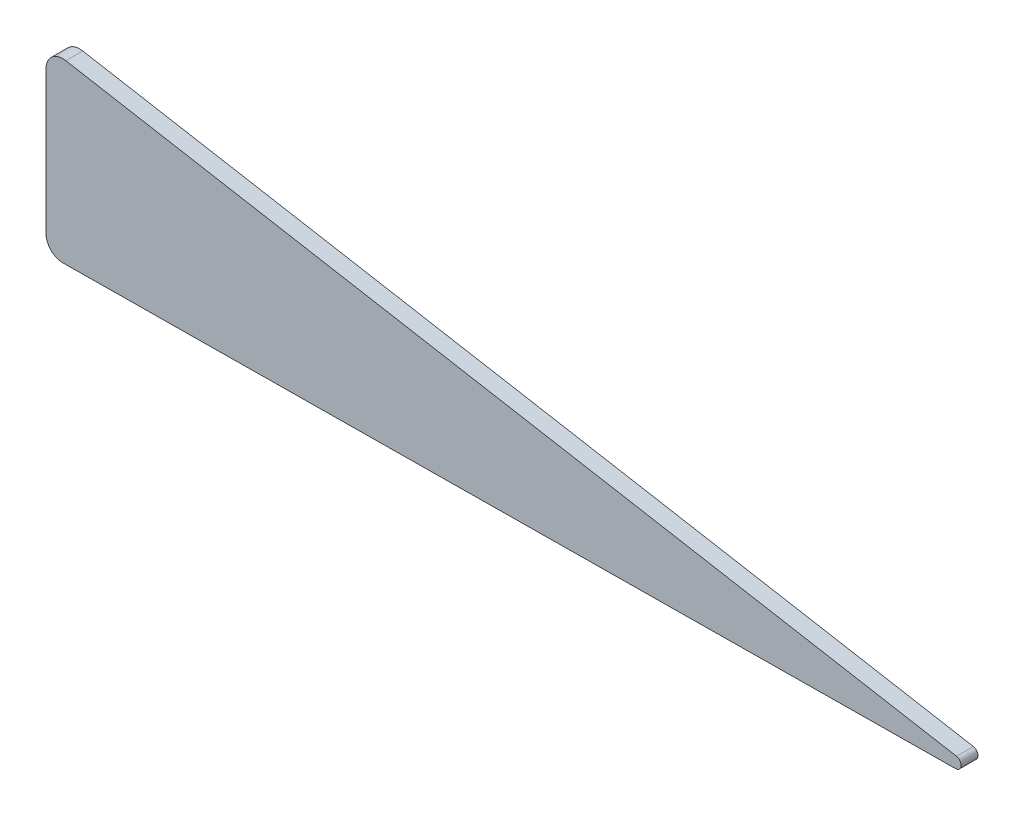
ISO-10303-21;
HEADER;
FILE_DESCRIPTION(('STEP AP214'),'2;1');
FILE_NAME('part.step','',(''),(''),'','','');
FILE_SCHEMA(('AUTOMOTIVE_DESIGN { 1 0 10303 214 1 1 1 1 }'));
ENDSEC;
DATA;
#1=APPLICATION_CONTEXT('core data for automotive mechanical design processes');
#2=APPLICATION_PROTOCOL_DEFINITION('international standard','automotive_design',2000,#1);
#3=PRODUCT_CONTEXT('',#1,'mechanical');
#4=PRODUCT('Part','Part','',(#3));
#5=PRODUCT_RELATED_PRODUCT_CATEGORY('part','',(#4));
#6=PRODUCT_DEFINITION_FORMATION('','',#4);
#7=PRODUCT_DEFINITION_CONTEXT('part definition',#1,'design');
#8=PRODUCT_DEFINITION('design','',#6,#7);
#9=PRODUCT_DEFINITION_SHAPE('','',#8);
#10=(LENGTH_UNIT() NAMED_UNIT(*) SI_UNIT(.MILLI.,.METRE.));
#11=(NAMED_UNIT(*) PLANE_ANGLE_UNIT() SI_UNIT($,.RADIAN.));
#12=(NAMED_UNIT(*) SI_UNIT($,.STERADIAN.) SOLID_ANGLE_UNIT());
#13=UNCERTAINTY_MEASURE_WITH_UNIT(LENGTH_MEASURE(1.E-05),#10,'distance_accuracy_value','');
#14=(GEOMETRIC_REPRESENTATION_CONTEXT(3) GLOBAL_UNCERTAINTY_ASSIGNED_CONTEXT((#13)) GLOBAL_UNIT_ASSIGNED_CONTEXT((#10,
#11,#12)) REPRESENTATION_CONTEXT('',''));
#15=CARTESIAN_POINT('',(0.,0.,0.));
#16=DIRECTION('',(0.,0.,1.));
#17=DIRECTION('',(1.,0.,0.));
#18=AXIS2_PLACEMENT_3D('',#15,#16,#17);
#19=CARTESIAN_POINT('',(3.,3.02818424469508,1.5));
#20=DIRECTION('',(0.,0.,-1.));
#21=DIRECTION('',(-1.,0.,0.));
#22=AXIS2_PLACEMENT_3D('',#19,#20,#21);
#23=CYLINDRICAL_SURFACE('',#22,3.);
#24=CARTESIAN_POINT('',(3.,3.02818424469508,-1.5));
#25=DIRECTION('',(0.,0.,1.));
#26=DIRECTION('',(1.,0.,0.));
#27=AXIS2_PLACEMENT_3D('',#24,#25,#26);
#28=CIRCLE('',#27,3.);
#29=CARTESIAN_POINT('',(0.,3.02818424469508,-1.5));
#30=VERTEX_POINT('',#29);
#31=CARTESIAN_POINT('',(3.02805185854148,0.0283153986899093,-1.5));
#32=VERTEX_POINT('',#31);
#33=EDGE_CURVE('E84',#30,#32,#28,.T.);
#34=ORIENTED_EDGE('',*,*,#33,.T.);
#35=DIRECTION('',(0.,0.,-1.));
#36=VECTOR('',#35,1.);
#37=CARTESIAN_POINT('',(3.02805185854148,0.0283153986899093,1.5));
#38=LINE('',#37,#36);
#39=CARTESIAN_POINT('',(3.02805185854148,0.0283153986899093,1.5));
#40=VERTEX_POINT('',#39);
#41=EDGE_CURVE('E11',#40,#32,#38,.T.);
#42=ORIENTED_EDGE('',*,*,#41,.F.);
#43=CARTESIAN_POINT('',(3.,3.02818424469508,1.5));
#44=DIRECTION('',(0.,0.,1.));
#45=DIRECTION('',(1.,0.,0.));
#46=AXIS2_PLACEMENT_3D('',#43,#44,#45);
#47=CIRCLE('',#46,3.);
#48=CARTESIAN_POINT('',(0.,3.02818424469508,1.5));
#49=VERTEX_POINT('',#48);
#50=EDGE_CURVE('E107',#49,#40,#47,.T.);
#51=ORIENTED_EDGE('',*,*,#50,.F.);
#52=DIRECTION('',(0.,0.,-1.));
#53=VECTOR('',#52,1.);
#54=CARTESIAN_POINT('',(0.,3.02818424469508,1.5));
#55=LINE('',#54,#53);
#56=EDGE_CURVE('E97',#49,#30,#55,.T.);
#57=ORIENTED_EDGE('',*,*,#56,.T.);
#58=EDGE_LOOP('',(#34,#42,#51,#57));
#59=FACE_BOUND('',#58,.T.);
#60=ADVANCED_FACE('F28',(#59),#23,.T.);
#61=CARTESIAN_POINT('',(3.02805185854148,0.0283153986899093,1.5));
#62=DIRECTION('',(-0.00935061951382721,0.999956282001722,0.));
#63=DIRECTION('',(-0.999956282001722,-0.00935061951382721,0.));
#64=AXIS2_PLACEMENT_3D('',#61,#62,#63);
#65=PLANE('',#64);
#66=DIRECTION('',(0.999956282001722,0.00935061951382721,0.));
#67=VECTOR('',#66,1.);
#68=CARTESIAN_POINT('',(3.02805185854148,0.0283153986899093,-1.5));
#69=LINE('',#68,#67);
#70=CARTESIAN_POINT('',(161.496054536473,1.51015417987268,-1.5));
#71=VERTEX_POINT('',#70);
#72=EDGE_CURVE('E80',#32,#71,#69,.T.);
#73=ORIENTED_EDGE('',*,*,#72,.T.);
#74=DIRECTION('',(0.,0.,-1.));
#75=VECTOR('',#74,1.);
#76=CARTESIAN_POINT('',(161.496054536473,1.51015417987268,1.5));
#77=LINE('',#76,#75);
#78=CARTESIAN_POINT('',(161.496054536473,1.51015417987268,1.5));
#79=VERTEX_POINT('',#78);
#80=EDGE_CURVE('E35',#79,#71,#77,.T.);
#81=ORIENTED_EDGE('',*,*,#80,.F.);
#82=DIRECTION('',(0.999956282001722,0.00935061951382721,0.));
#83=VECTOR('',#82,1.);
#84=CARTESIAN_POINT('',(3.02805185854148,0.0283153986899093,1.5));
#85=LINE('',#84,#83);
#86=EDGE_CURVE('E93',#40,#79,#85,.T.);
#87=ORIENTED_EDGE('',*,*,#86,.F.);
#88=ORIENTED_EDGE('',*,*,#41,.T.);
#89=EDGE_LOOP('',(#73,#81,#87,#88));
#90=FACE_BOUND('',#89,.T.);
#91=ADVANCED_FACE('F92',(#90),#65,.F.);
#92=CARTESIAN_POINT('',(161.486703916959,2.5101104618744,1.5));
#93=DIRECTION('',(0.,0.,-1.));
#94=DIRECTION('',(-1.,0.,0.));
#95=AXIS2_PLACEMENT_3D('',#92,#93,#94);
#96=CYLINDRICAL_SURFACE('',#95,1.);
#97=CARTESIAN_POINT('',(161.486703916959,2.5101104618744,-1.5));
#98=DIRECTION('',(0.,0.,1.));
#99=DIRECTION('',(1.,0.,0.));
#100=AXIS2_PLACEMENT_3D('',#97,#98,#99);
#101=CIRCLE('',#100,1.);
#102=CARTESIAN_POINT('',(161.660352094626,3.49491821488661,-1.5));
#103=VERTEX_POINT('',#102);
#104=EDGE_CURVE('E86',#71,#103,#101,.T.);
#105=ORIENTED_EDGE('',*,*,#104,.T.);
#106=DIRECTION('',(0.,0.,-1.));
#107=VECTOR('',#106,1.);
#108=CARTESIAN_POINT('',(161.660352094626,3.49491821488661,1.5));
#109=LINE('',#108,#107);
#110=CARTESIAN_POINT('',(161.660352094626,3.49491821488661,1.5));
#111=VERTEX_POINT('',#110);
#112=EDGE_CURVE('E123',#111,#103,#109,.T.);
#113=ORIENTED_EDGE('',*,*,#112,.F.);
#114=CARTESIAN_POINT('',(161.486703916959,2.5101104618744,1.5));
#115=DIRECTION('',(0.,0.,1.));
#116=DIRECTION('',(1.,0.,0.));
#117=AXIS2_PLACEMENT_3D('',#114,#115,#116);
#118=CIRCLE('',#117,1.);
#119=EDGE_CURVE('E110',#79,#111,#118,.T.);
#120=ORIENTED_EDGE('',*,*,#119,.F.);
#121=ORIENTED_EDGE('',*,*,#80,.T.);
#122=EDGE_LOOP('',(#105,#113,#120,#121));
#123=FACE_BOUND('',#122,.T.);
#124=ADVANCED_FACE('F127',(#123),#96,.T.);
#125=CARTESIAN_POINT('',(3.5209445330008,31.379162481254,1.5));
#126=DIRECTION('',(-0.173648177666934,-0.984807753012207,0.));
#127=DIRECTION('',(0.984807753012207,-0.173648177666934,0.));
#128=AXIS2_PLACEMENT_3D('',#125,#126,#127);
#129=PLANE('',#128);
#130=DIRECTION('',(-0.984807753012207,0.173648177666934,0.));
#131=VECTOR('',#130,1.);
#132=CARTESIAN_POINT('',(3.5209445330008,31.379162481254,-1.5));
#133=LINE('',#132,#131);
#134=CARTESIAN_POINT('',(3.5209445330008,31.379162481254,-1.5));
#135=VERTEX_POINT('',#134);
#136=EDGE_CURVE('E101',#103,#135,#133,.T.);
#137=ORIENTED_EDGE('',*,*,#136,.T.);
#138=DIRECTION('',(0.,0.,-1.));
#139=VECTOR('',#138,1.);
#140=CARTESIAN_POINT('',(3.5209445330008,31.379162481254,1.5));
#141=LINE('',#140,#139);
#142=CARTESIAN_POINT('',(3.5209445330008,31.379162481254,1.5));
#143=VERTEX_POINT('',#142);
#144=EDGE_CURVE('E120',#143,#135,#141,.T.);
#145=ORIENTED_EDGE('',*,*,#144,.F.);
#146=DIRECTION('',(-0.984807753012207,0.173648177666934,0.));
#147=VECTOR('',#146,1.);
#148=CARTESIAN_POINT('',(3.5209445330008,31.379162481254,1.5));
#149=LINE('',#148,#147);
#150=EDGE_CURVE('E112',#111,#143,#149,.T.);
#151=ORIENTED_EDGE('',*,*,#150,.F.);
#152=ORIENTED_EDGE('',*,*,#112,.T.);
#153=EDGE_LOOP('',(#137,#145,#151,#152));
#154=FACE_BOUND('',#153,.T.);
#155=ADVANCED_FACE('F133',(#154),#129,.F.);
#156=CARTESIAN_POINT('',(3.,28.4247392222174,1.5));
#157=DIRECTION('',(0.,0.,-1.));
#158=DIRECTION('',(-1.,0.,0.));
#159=AXIS2_PLACEMENT_3D('',#156,#157,#158);
#160=CYLINDRICAL_SURFACE('',#159,3.);
#161=CARTESIAN_POINT('',(3.,28.4247392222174,-1.5));
#162=DIRECTION('',(0.,0.,1.));
#163=DIRECTION('',(-1.,0.,0.));
#164=AXIS2_PLACEMENT_3D('',#161,#162,#163);
#165=CIRCLE('',#164,3.);
#166=CARTESIAN_POINT('',(0.,28.4247392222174,-1.5));
#167=VERTEX_POINT('',#166);
#168=EDGE_CURVE('E103',#135,#167,#165,.T.);
#169=ORIENTED_EDGE('',*,*,#168,.T.);
#170=DIRECTION('',(0.,0.,-1.));
#171=VECTOR('',#170,1.);
#172=CARTESIAN_POINT('',(0.,28.4247392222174,1.5));
#173=LINE('',#172,#171);
#174=CARTESIAN_POINT('',(0.,28.4247392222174,1.5));
#175=VERTEX_POINT('',#174);
#176=EDGE_CURVE('E117',#175,#167,#173,.T.);
#177=ORIENTED_EDGE('',*,*,#176,.F.);
#178=CARTESIAN_POINT('',(3.,28.4247392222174,1.5));
#179=DIRECTION('',(0.,0.,1.));
#180=DIRECTION('',(-1.,0.,0.));
#181=AXIS2_PLACEMENT_3D('',#178,#179,#180);
#182=CIRCLE('',#181,3.);
#183=EDGE_CURVE('E47',#143,#175,#182,.T.);
#184=ORIENTED_EDGE('',*,*,#183,.F.);
#185=ORIENTED_EDGE('',*,*,#144,.T.);
#186=EDGE_LOOP('',(#169,#177,#184,#185));
#187=FACE_BOUND('',#186,.T.);
#188=ADVANCED_FACE('F136',(#187),#160,.T.);
#189=CARTESIAN_POINT('',(0.,3.02818424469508,1.5));
#190=DIRECTION('',(1.,0.,0.));
#191=DIRECTION('',(0.,0.,-1.));
#192=AXIS2_PLACEMENT_3D('',#189,#190,#191);
#193=PLANE('',#192);
#194=DIRECTION('',(0.,-1.,0.));
#195=VECTOR('',#194,1.);
#196=CARTESIAN_POINT('',(0.,3.02818424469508,-1.5));
#197=LINE('',#196,#195);
#198=EDGE_CURVE('E105',#167,#30,#197,.T.);
#199=ORIENTED_EDGE('',*,*,#198,.T.);
#200=ORIENTED_EDGE('',*,*,#56,.F.);
#201=DIRECTION('',(0.,-1.,0.));
#202=VECTOR('',#201,1.);
#203=CARTESIAN_POINT('',(0.,3.02818424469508,1.5));
#204=LINE('',#203,#202);
#205=EDGE_CURVE('E42',#175,#49,#204,.T.);
#206=ORIENTED_EDGE('',*,*,#205,.F.);
#207=ORIENTED_EDGE('',*,*,#176,.T.);
#208=EDGE_LOOP('',(#199,#200,#206,#207));
#209=FACE_BOUND('',#208,.T.);
#210=ADVANCED_FACE('F138',(#209),#193,.F.);
#211=CARTESIAN_POINT('',(3.,3.02818424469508,1.5));
#212=DIRECTION('',(0.,0.,1.));
#213=DIRECTION('',(1.,0.,0.));
#214=AXIS2_PLACEMENT_3D('',#211,#212,#213);
#215=PLANE('',#214);
#216=ORIENTED_EDGE('',*,*,#50,.T.);
#217=ORIENTED_EDGE('',*,*,#86,.T.);
#218=ORIENTED_EDGE('',*,*,#119,.T.);
#219=ORIENTED_EDGE('',*,*,#150,.T.);
#220=ORIENTED_EDGE('',*,*,#183,.T.);
#221=ORIENTED_EDGE('',*,*,#205,.T.);
#222=EDGE_LOOP('',(#216,#217,#218,#219,#220,#221));
#223=FACE_BOUND('',#222,.T.);
#224=ADVANCED_FACE('F130',(#223),#215,.T.);
#225=CARTESIAN_POINT('',(3.,3.02818424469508,-1.5));
#226=DIRECTION('',(0.,0.,1.));
#227=DIRECTION('',(1.,0.,0.));
#228=AXIS2_PLACEMENT_3D('',#225,#226,#227);
#229=PLANE('',#228);
#230=ORIENTED_EDGE('',*,*,#33,.F.);
#231=ORIENTED_EDGE('',*,*,#198,.F.);
#232=ORIENTED_EDGE('',*,*,#168,.F.);
#233=ORIENTED_EDGE('',*,*,#136,.F.);
#234=ORIENTED_EDGE('',*,*,#104,.F.);
#235=ORIENTED_EDGE('',*,*,#72,.F.);
#236=EDGE_LOOP('',(#230,#231,#232,#233,#234,#235));
#237=FACE_BOUND('',#236,.T.);
#238=ADVANCED_FACE('F81',(#237),#229,.F.);
#239=CLOSED_SHELL('',(#60,#91,#124,#155,#188,#210,#224,#238));
#240=MANIFOLD_SOLID_BREP('B2',#239);
#241=ADVANCED_BREP_SHAPE_REPRESENTATION('',(#18,#240),#14);
#242=SHAPE_DEFINITION_REPRESENTATION(#9,#241);
ENDSEC;
END-ISO-10303-21;
